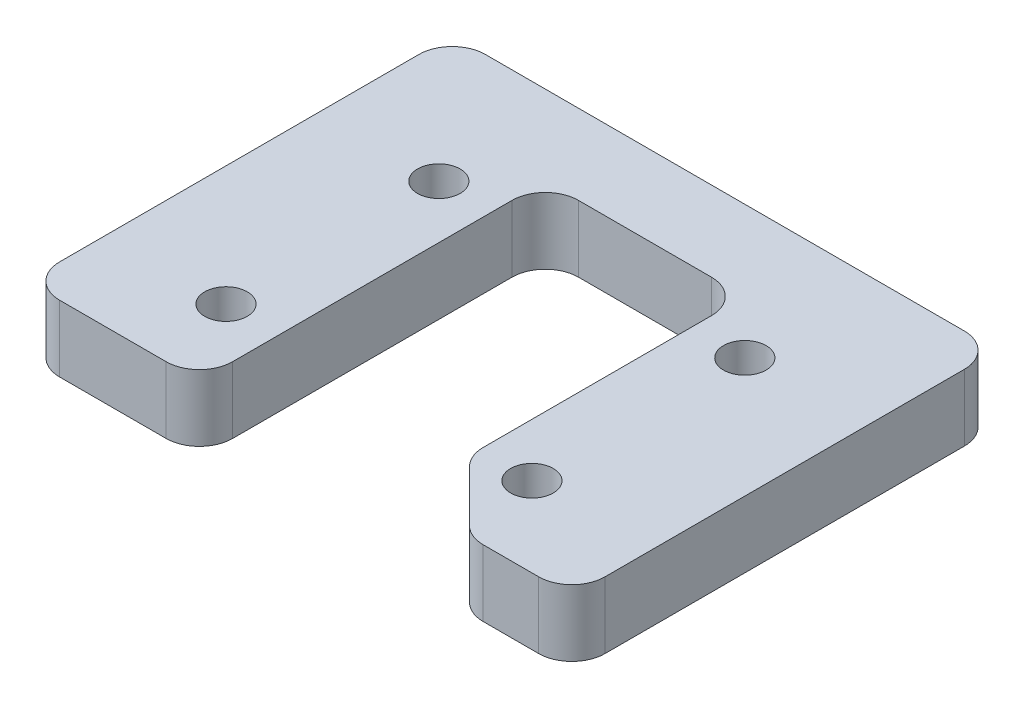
from build123d import *

# Parameters (mm, degrees)
ESQUISSE1_W          = 82
ESQUISSE1_H          = 64
BRUT_RECTANGLE_DEPTH = 10
EVIDEMENT_DEPTH      = 10
ESQUISSE3_R          = 3.2
PASSAGES_VIS_DEPTH   = 10
CONG_1_R             = 5


with BuildPart() as part:
    # Esquisse1 → brut rectangle (new body)
    with BuildSketch(Plane(origin=(0, 0, 0), x_dir=(1, 0, 0), z_dir=(0, 1, 0))):
        Rectangle(ESQUISSE1_W, ESQUISSE1_H)
    extrude(amount=BRUT_RECTANGLE_DEPTH)

    # Esquisse2 → Evidement (cut)
    with BuildSketch(Plane(origin=(0, 10, 0), x_dir=(-1, 0, 0), z_dir=(0, 1, 0))):
        Polygon((-15, -20), (-15, 21.393398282), (-25.606601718, 32), (15, 32), (15, -20), align=None)
    extrude(amount=-EVIDEMENT_DEPTH, mode=Mode.SUBTRACT)

    # Esquisse3 → Passages vis (cut)
    with BuildSketch(Plane(origin=(0, 10, 0), x_dir=(-1, 0, 0), z_dir=(0, 1, 0))):
        with Locations(Location((23, -12, 0), (0, 0, 90))):
            Circle(ESQUISSE3_R)
        with Locations(Location((23, 20, 0), (0, 0, 90))):
            Circle(ESQUISSE3_R)
        with Locations(Location((-23, 20, 0), (0, 0, 90))):
            Circle(ESQUISSE3_R)
        with Locations(Location((-23, -12, 0), (0, 0, 90))):
            Circle(ESQUISSE3_R)
    extrude(amount=-PASSAGES_VIS_DEPTH, mode=Mode.SUBTRACT)

    # Cong_1
    cong_1_edges = [part.edges().sort_by_distance(p)[0] for p in [
        (25.606601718, 5, 32),
        (-15, 5, 32),
        (-15, 5, -20),
        (15, 5, -20),
        (15, 5, 21.393398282),
        (41, 5, 32),
        (-41, 5, 32),
        (-41, 5, -32),
        (41, 5, -32),
    ]]
    fillet(cong_1_edges, radius=CONG_1_R)


solid = part.part
